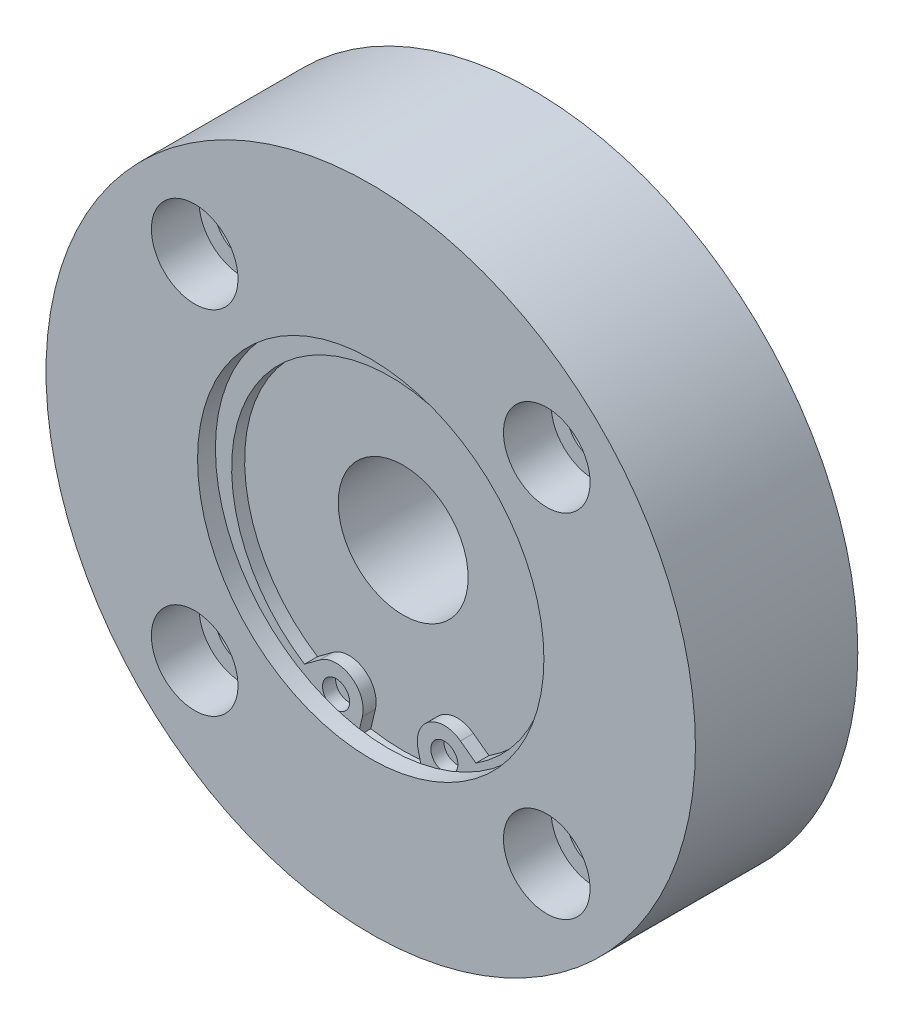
ISO-10303-21;
HEADER;
FILE_DESCRIPTION(('STEP AP214'),'2;1');
FILE_NAME('part.step','',(''),(''),'','','');
FILE_SCHEMA(('AUTOMOTIVE_DESIGN { 1 0 10303 214 1 1 1 1 }'));
ENDSEC;
DATA;
#1=APPLICATION_CONTEXT('core data for automotive mechanical design processes');
#2=APPLICATION_PROTOCOL_DEFINITION('international standard','automotive_design',2000,#1);
#3=PRODUCT_CONTEXT('',#1,'mechanical');
#4=PRODUCT('Part','Part','',(#3));
#5=PRODUCT_RELATED_PRODUCT_CATEGORY('part','',(#4));
#6=PRODUCT_DEFINITION_FORMATION('','',#4);
#7=PRODUCT_DEFINITION_CONTEXT('part definition',#1,'design');
#8=PRODUCT_DEFINITION('design','',#6,#7);
#9=PRODUCT_DEFINITION_SHAPE('','',#8);
#10=(LENGTH_UNIT() NAMED_UNIT(*) SI_UNIT(.MILLI.,.METRE.));
#11=(NAMED_UNIT(*) PLANE_ANGLE_UNIT() SI_UNIT($,.RADIAN.));
#12=(NAMED_UNIT(*) SI_UNIT($,.STERADIAN.) SOLID_ANGLE_UNIT());
#13=UNCERTAINTY_MEASURE_WITH_UNIT(LENGTH_MEASURE(1.E-05),#10,'distance_accuracy_value','');
#14=(GEOMETRIC_REPRESENTATION_CONTEXT(3) GLOBAL_UNCERTAINTY_ASSIGNED_CONTEXT((#13)) GLOBAL_UNIT_ASSIGNED_CONTEXT((#10,
#11,#12)) REPRESENTATION_CONTEXT('',''));
#15=CARTESIAN_POINT('',(0.,0.,0.));
#16=DIRECTION('',(0.,0.,1.));
#17=DIRECTION('',(1.,0.,0.));
#18=AXIS2_PLACEMENT_3D('',#15,#16,#17);
#19=CARTESIAN_POINT('',(16.2634559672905,16.2634559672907,0.));
#20=DIRECTION('',(0.,0.,1.));
#21=DIRECTION('',(1.,0.,0.));
#22=AXIS2_PLACEMENT_3D('',#19,#20,#21);
#23=CYLINDRICAL_SURFACE('',#22,2.5);
#24=CARTESIAN_POINT('',(16.2634559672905,16.2634559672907,0.));
#25=DIRECTION('',(0.,0.,1.));
#26=DIRECTION('',(1.,0.,0.));
#27=AXIS2_PLACEMENT_3D('',#24,#25,#26);
#28=CIRCLE('',#27,2.5);
#29=CARTESIAN_POINT('',(18.7634559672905,16.2634559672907,0.));
#30=VERTEX_POINT('',#29);
#31=EDGE_CURVE('E219',#30,#30,#28,.T.);
#32=ORIENTED_EDGE('',*,*,#31,.F.);
#33=EDGE_LOOP('',(#32));
#34=FACE_BOUND('',#33,.T.);
#35=CARTESIAN_POINT('',(16.2634559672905,16.2634559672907,10.6));
#36=DIRECTION('',(0.,0.,1.));
#37=DIRECTION('',(1.,0.,0.));
#38=AXIS2_PLACEMENT_3D('',#35,#36,#37);
#39=CIRCLE('',#38,2.5);
#40=CARTESIAN_POINT('',(18.7634559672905,16.2634559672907,10.6));
#41=VERTEX_POINT('',#40);
#42=EDGE_CURVE('E218',#41,#41,#39,.F.);
#43=ORIENTED_EDGE('',*,*,#42,.F.);
#44=EDGE_LOOP('',(#43));
#45=FACE_BOUND('',#44,.T.);
#46=ADVANCED_FACE('F14',(#34,#45),#23,.F.);
#47=CARTESIAN_POINT('',(16.2634559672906,-16.2634559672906,0.));
#48=DIRECTION('',(0.,0.,1.));
#49=DIRECTION('',(1.,0.,0.));
#50=AXIS2_PLACEMENT_3D('',#47,#48,#49);
#51=CYLINDRICAL_SURFACE('',#50,2.5);
#52=CARTESIAN_POINT('',(16.2634559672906,-16.2634559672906,0.));
#53=DIRECTION('',(0.,0.,1.));
#54=DIRECTION('',(0.,-1.,0.));
#55=AXIS2_PLACEMENT_3D('',#52,#53,#54);
#56=CIRCLE('',#55,2.5);
#57=CARTESIAN_POINT('',(16.2634559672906,-18.7634559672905,0.));
#58=VERTEX_POINT('',#57);
#59=EDGE_CURVE('E209',#58,#58,#56,.T.);
#60=ORIENTED_EDGE('',*,*,#59,.F.);
#61=EDGE_LOOP('',(#60));
#62=FACE_BOUND('',#61,.T.);
#63=CARTESIAN_POINT('',(16.2634559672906,-16.2634559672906,10.6));
#64=DIRECTION('',(0.,0.,1.));
#65=DIRECTION('',(1.,0.,0.));
#66=AXIS2_PLACEMENT_3D('',#63,#64,#65);
#67=CIRCLE('',#66,2.5);
#68=CARTESIAN_POINT('',(18.7634559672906,-16.2634559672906,10.6));
#69=VERTEX_POINT('',#68);
#70=EDGE_CURVE('E202',#69,#69,#67,.F.);
#71=ORIENTED_EDGE('',*,*,#70,.F.);
#72=EDGE_LOOP('',(#71));
#73=FACE_BOUND('',#72,.T.);
#74=ADVANCED_FACE('F320',(#62,#73),#51,.F.);
#75=CARTESIAN_POINT('',(-16.2634559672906,-16.2634559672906,0.));
#76=DIRECTION('',(0.,0.,1.));
#77=DIRECTION('',(1.,0.,0.));
#78=AXIS2_PLACEMENT_3D('',#75,#76,#77);
#79=CYLINDRICAL_SURFACE('',#78,2.5);
#80=CARTESIAN_POINT('',(-16.2634559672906,-16.2634559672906,0.));
#81=DIRECTION('',(0.,0.,1.));
#82=DIRECTION('',(-1.,0.,0.));
#83=AXIS2_PLACEMENT_3D('',#80,#81,#82);
#84=CIRCLE('',#83,2.5);
#85=CARTESIAN_POINT('',(-18.7634559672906,-16.2634559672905,0.));
#86=VERTEX_POINT('',#85);
#87=EDGE_CURVE('E206',#86,#86,#84,.T.);
#88=ORIENTED_EDGE('',*,*,#87,.F.);
#89=EDGE_LOOP('',(#88));
#90=FACE_BOUND('',#89,.T.);
#91=CARTESIAN_POINT('',(-16.2634559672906,-16.2634559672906,10.6));
#92=DIRECTION('',(0.,0.,1.));
#93=DIRECTION('',(1.,0.,0.));
#94=AXIS2_PLACEMENT_3D('',#91,#92,#93);
#95=CIRCLE('',#94,2.5);
#96=CARTESIAN_POINT('',(-13.7634559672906,-16.2634559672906,10.6));
#97=VERTEX_POINT('',#96);
#98=EDGE_CURVE('E195',#97,#97,#95,.F.);
#99=ORIENTED_EDGE('',*,*,#98,.F.);
#100=EDGE_LOOP('',(#99));
#101=FACE_BOUND('',#100,.T.);
#102=ADVANCED_FACE('F326',(#90,#101),#79,.F.);
#103=CARTESIAN_POINT('',(-16.2634559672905,16.2634559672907,0.));
#104=DIRECTION('',(0.,0.,1.));
#105=DIRECTION('',(1.,0.,0.));
#106=AXIS2_PLACEMENT_3D('',#103,#104,#105);
#107=CYLINDRICAL_SURFACE('',#106,2.5);
#108=CARTESIAN_POINT('',(-16.2634559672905,16.2634559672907,0.));
#109=DIRECTION('',(0.,0.,1.));
#110=DIRECTION('',(0.,1.,0.));
#111=AXIS2_PLACEMENT_3D('',#108,#109,#110);
#112=CIRCLE('',#111,2.5);
#113=CARTESIAN_POINT('',(-16.2634559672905,18.7634559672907,0.));
#114=VERTEX_POINT('',#113);
#115=EDGE_CURVE('E203',#114,#114,#112,.T.);
#116=ORIENTED_EDGE('',*,*,#115,.F.);
#117=EDGE_LOOP('',(#116));
#118=FACE_BOUND('',#117,.T.);
#119=CARTESIAN_POINT('',(-16.2634559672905,16.2634559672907,10.6));
#120=DIRECTION('',(0.,0.,1.));
#121=DIRECTION('',(1.,0.,0.));
#122=AXIS2_PLACEMENT_3D('',#119,#120,#121);
#123=CIRCLE('',#122,2.5);
#124=CARTESIAN_POINT('',(-13.7634559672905,16.2634559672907,10.6));
#125=VERTEX_POINT('',#124);
#126=EDGE_CURVE('E188',#125,#125,#123,.F.);
#127=ORIENTED_EDGE('',*,*,#126,.F.);
#128=EDGE_LOOP('',(#127));
#129=FACE_BOUND('',#128,.T.);
#130=ADVANCED_FACE('F519',(#118,#129),#107,.F.);
#131=CARTESIAN_POINT('',(16.2634559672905,16.2634559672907,10.6));
#132=DIRECTION('',(0.,0.,1.));
#133=DIRECTION('',(1.,0.,0.));
#134=AXIS2_PLACEMENT_3D('',#131,#132,#133);
#135=PLANE('',#134);
#136=CARTESIAN_POINT('',(16.2634559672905,16.2634559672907,10.6));
#137=DIRECTION('',(0.,0.,1.));
#138=DIRECTION('',(1.,0.,0.));
#139=AXIS2_PLACEMENT_3D('',#136,#137,#138);
#140=CIRCLE('',#139,4.);
#141=CARTESIAN_POINT('',(20.2634559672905,16.2634559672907,10.6));
#142=VERTEX_POINT('',#141);
#143=EDGE_CURVE('E215',#142,#142,#140,.T.);
#144=ORIENTED_EDGE('',*,*,#143,.T.);
#145=EDGE_LOOP('',(#144));
#146=FACE_BOUND('',#145,.T.);
#147=ORIENTED_EDGE('',*,*,#42,.T.);
#148=EDGE_LOOP('',(#147));
#149=FACE_BOUND('',#148,.T.);
#150=ADVANCED_FACE('F531',(#146,#149),#135,.T.);
#151=CARTESIAN_POINT('',(16.2634559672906,-16.2634559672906,10.6));
#152=DIRECTION('',(0.,0.,1.));
#153=DIRECTION('',(0.,-1.,0.));
#154=AXIS2_PLACEMENT_3D('',#151,#152,#153);
#155=PLANE('',#154);
#156=CARTESIAN_POINT('',(16.2634559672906,-16.2634559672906,10.6));
#157=DIRECTION('',(0.,0.,1.));
#158=DIRECTION('',(0.,-1.,0.));
#159=AXIS2_PLACEMENT_3D('',#156,#157,#158);
#160=CIRCLE('',#159,4.);
#161=CARTESIAN_POINT('',(16.2634559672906,-20.2634559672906,10.6));
#162=VERTEX_POINT('',#161);
#163=EDGE_CURVE('E199',#162,#162,#160,.T.);
#164=ORIENTED_EDGE('',*,*,#163,.T.);
#165=EDGE_LOOP('',(#164));
#166=FACE_BOUND('',#165,.T.);
#167=ORIENTED_EDGE('',*,*,#70,.T.);
#168=EDGE_LOOP('',(#167));
#169=FACE_BOUND('',#168,.T.);
#170=ADVANCED_FACE('F526',(#166,#169),#155,.T.);
#171=CARTESIAN_POINT('',(-16.2634559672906,-16.2634559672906,10.6));
#172=DIRECTION('',(0.,0.,1.));
#173=DIRECTION('',(-1.,0.,0.));
#174=AXIS2_PLACEMENT_3D('',#171,#172,#173);
#175=PLANE('',#174);
#176=CARTESIAN_POINT('',(-16.2634559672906,-16.2634559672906,10.6));
#177=DIRECTION('',(0.,0.,1.));
#178=DIRECTION('',(-1.,0.,0.));
#179=AXIS2_PLACEMENT_3D('',#176,#177,#178);
#180=CIRCLE('',#179,4.);
#181=CARTESIAN_POINT('',(-20.2634559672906,-16.2634559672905,10.6));
#182=VERTEX_POINT('',#181);
#183=EDGE_CURVE('E192',#182,#182,#180,.T.);
#184=ORIENTED_EDGE('',*,*,#183,.T.);
#185=EDGE_LOOP('',(#184));
#186=FACE_BOUND('',#185,.T.);
#187=ORIENTED_EDGE('',*,*,#98,.T.);
#188=EDGE_LOOP('',(#187));
#189=FACE_BOUND('',#188,.T.);
#190=ADVANCED_FACE('F499',(#186,#189),#175,.T.);
#191=CARTESIAN_POINT('',(-16.2634559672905,16.2634559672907,10.6));
#192=DIRECTION('',(0.,0.,1.));
#193=DIRECTION('',(0.,1.,0.));
#194=AXIS2_PLACEMENT_3D('',#191,#192,#193);
#195=PLANE('',#194);
#196=CARTESIAN_POINT('',(-16.2634559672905,16.2634559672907,10.6));
#197=DIRECTION('',(0.,0.,1.));
#198=DIRECTION('',(0.,1.,0.));
#199=AXIS2_PLACEMENT_3D('',#196,#197,#198);
#200=CIRCLE('',#199,4.);
#201=CARTESIAN_POINT('',(-16.2634559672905,20.2634559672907,10.6));
#202=VERTEX_POINT('',#201);
#203=EDGE_CURVE('E185',#202,#202,#200,.T.);
#204=ORIENTED_EDGE('',*,*,#203,.T.);
#205=EDGE_LOOP('',(#204));
#206=FACE_BOUND('',#205,.T.);
#207=ORIENTED_EDGE('',*,*,#126,.T.);
#208=EDGE_LOOP('',(#207));
#209=FACE_BOUND('',#208,.T.);
#210=ADVANCED_FACE('F344',(#206,#209),#195,.T.);
#211=CARTESIAN_POINT('',(0.,0.,0.));
#212=DIRECTION('',(0.,0.,1.));
#213=DIRECTION('',(1.,0.,0.));
#214=AXIS2_PLACEMENT_3D('',#211,#212,#213);
#215=PLANE('',#214);
#216=CARTESIAN_POINT('',(0.,0.,0.));
#217=DIRECTION('',(0.,0.,-1.));
#218=DIRECTION('',(-1.,0.,0.));
#219=AXIS2_PLACEMENT_3D('',#216,#217,#218);
#220=CIRCLE('',#219,13.);
#221=CARTESIAN_POINT('',(-13.,0.,0.));
#222=VERTEX_POINT('',#221);
#223=EDGE_CURVE('E171',#222,#222,#220,.T.);
#224=ORIENTED_EDGE('',*,*,#223,.F.);
#225=EDGE_LOOP('',(#224));
#226=FACE_BOUND('',#225,.T.);
#227=ORIENTED_EDGE('',*,*,#115,.T.);
#228=EDGE_LOOP('',(#227));
#229=FACE_BOUND('',#228,.T.);
#230=ORIENTED_EDGE('',*,*,#87,.T.);
#231=EDGE_LOOP('',(#230));
#232=FACE_BOUND('',#231,.T.);
#233=ORIENTED_EDGE('',*,*,#59,.T.);
#234=EDGE_LOOP('',(#233));
#235=FACE_BOUND('',#234,.T.);
#236=ORIENTED_EDGE('',*,*,#31,.T.);
#237=EDGE_LOOP('',(#236));
#238=FACE_BOUND('',#237,.T.);
#239=CARTESIAN_POINT('',(0.,0.,0.));
#240=DIRECTION('',(0.,0.,1.));
#241=DIRECTION('',(1.,0.,0.));
#242=AXIS2_PLACEMENT_3D('',#239,#240,#241);
#243=CIRCLE('',#242,30.);
#244=CARTESIAN_POINT('',(30.,0.,0.));
#245=VERTEX_POINT('',#244);
#246=EDGE_CURVE('E222',#245,#245,#243,.T.);
#247=ORIENTED_EDGE('',*,*,#246,.F.);
#248=EDGE_LOOP('',(#247));
#249=FACE_BOUND('',#248,.T.);
#250=ADVANCED_FACE('F340',(#226,#229,#232,#235,#238,#249),#215,.F.);
#251=CARTESIAN_POINT('',(0.,0.,15.));
#252=DIRECTION('',(0.,0.,-1.));
#253=DIRECTION('',(-1.,0.,0.));
#254=AXIS2_PLACEMENT_3D('',#251,#252,#253);
#255=CYLINDRICAL_SURFACE('',#254,30.);
#256=CARTESIAN_POINT('',(0.,0.,15.));
#257=DIRECTION('',(0.,0.,1.));
#258=DIRECTION('',(1.,0.,0.));
#259=AXIS2_PLACEMENT_3D('',#256,#257,#258);
#260=CIRCLE('',#259,30.);
#261=CARTESIAN_POINT('',(30.,0.,15.));
#262=VERTEX_POINT('',#261);
#263=EDGE_CURVE('E225',#262,#262,#260,.T.);
#264=ORIENTED_EDGE('',*,*,#263,.F.);
#265=EDGE_LOOP('',(#264));
#266=FACE_BOUND('',#265,.T.);
#267=ORIENTED_EDGE('',*,*,#246,.T.);
#268=EDGE_LOOP('',(#267));
#269=FACE_BOUND('',#268,.T.);
#270=ADVANCED_FACE('F343',(#266,#269),#255,.T.);
#271=CARTESIAN_POINT('',(16.2634559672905,16.2634559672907,10.6));
#272=DIRECTION('',(0.,0.,1.));
#273=DIRECTION('',(1.,0.,0.));
#274=AXIS2_PLACEMENT_3D('',#271,#272,#273);
#275=CYLINDRICAL_SURFACE('',#274,4.);
#276=ORIENTED_EDGE('',*,*,#143,.F.);
#277=EDGE_LOOP('',(#276));
#278=FACE_BOUND('',#277,.T.);
#279=CARTESIAN_POINT('',(16.2634559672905,16.2634559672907,15.));
#280=DIRECTION('',(0.,0.,1.));
#281=DIRECTION('',(1.,0.,0.));
#282=AXIS2_PLACEMENT_3D('',#279,#280,#281);
#283=CIRCLE('',#282,4.);
#284=CARTESIAN_POINT('',(20.2634559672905,16.2634559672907,15.));
#285=VERTEX_POINT('',#284);
#286=EDGE_CURVE('E212',#285,#285,#283,.T.);
#287=ORIENTED_EDGE('',*,*,#286,.T.);
#288=EDGE_LOOP('',(#287));
#289=FACE_BOUND('',#288,.T.);
#290=ADVANCED_FACE('F333',(#278,#289),#275,.F.);
#291=CARTESIAN_POINT('',(16.2634559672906,-16.2634559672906,10.6));
#292=DIRECTION('',(0.,0.,1.));
#293=DIRECTION('',(1.,0.,0.));
#294=AXIS2_PLACEMENT_3D('',#291,#292,#293);
#295=CYLINDRICAL_SURFACE('',#294,4.);
#296=ORIENTED_EDGE('',*,*,#163,.F.);
#297=EDGE_LOOP('',(#296));
#298=FACE_BOUND('',#297,.T.);
#299=CARTESIAN_POINT('',(16.2634559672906,-16.2634559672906,15.));
#300=DIRECTION('',(0.,0.,1.));
#301=DIRECTION('',(0.,-1.,0.));
#302=AXIS2_PLACEMENT_3D('',#299,#300,#301);
#303=CIRCLE('',#302,4.);
#304=CARTESIAN_POINT('',(16.2634559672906,-20.2634559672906,15.));
#305=VERTEX_POINT('',#304);
#306=EDGE_CURVE('E196',#305,#305,#303,.T.);
#307=ORIENTED_EDGE('',*,*,#306,.T.);
#308=EDGE_LOOP('',(#307));
#309=FACE_BOUND('',#308,.T.);
#310=ADVANCED_FACE('F509',(#298,#309),#295,.F.);
#311=CARTESIAN_POINT('',(-16.2634559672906,-16.2634559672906,10.6));
#312=DIRECTION('',(0.,0.,1.));
#313=DIRECTION('',(1.,0.,0.));
#314=AXIS2_PLACEMENT_3D('',#311,#312,#313);
#315=CYLINDRICAL_SURFACE('',#314,4.);
#316=ORIENTED_EDGE('',*,*,#183,.F.);
#317=EDGE_LOOP('',(#316));
#318=FACE_BOUND('',#317,.T.);
#319=CARTESIAN_POINT('',(-16.2634559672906,-16.2634559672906,15.));
#320=DIRECTION('',(0.,0.,1.));
#321=DIRECTION('',(-1.,0.,0.));
#322=AXIS2_PLACEMENT_3D('',#319,#320,#321);
#323=CIRCLE('',#322,4.);
#324=CARTESIAN_POINT('',(-20.2634559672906,-16.2634559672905,15.));
#325=VERTEX_POINT('',#324);
#326=EDGE_CURVE('E189',#325,#325,#323,.T.);
#327=ORIENTED_EDGE('',*,*,#326,.T.);
#328=EDGE_LOOP('',(#327));
#329=FACE_BOUND('',#328,.T.);
#330=ADVANCED_FACE('F489',(#318,#329),#315,.F.);
#331=CARTESIAN_POINT('',(-16.2634559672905,16.2634559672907,10.6));
#332=DIRECTION('',(0.,0.,1.));
#333=DIRECTION('',(1.,0.,0.));
#334=AXIS2_PLACEMENT_3D('',#331,#332,#333);
#335=CYLINDRICAL_SURFACE('',#334,4.);
#336=ORIENTED_EDGE('',*,*,#203,.F.);
#337=EDGE_LOOP('',(#336));
#338=FACE_BOUND('',#337,.T.);
#339=CARTESIAN_POINT('',(-16.2634559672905,16.2634559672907,15.));
#340=DIRECTION('',(0.,0.,1.));
#341=DIRECTION('',(0.,1.,0.));
#342=AXIS2_PLACEMENT_3D('',#339,#340,#341);
#343=CIRCLE('',#342,4.);
#344=CARTESIAN_POINT('',(-16.2634559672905,20.2634559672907,15.));
#345=VERTEX_POINT('',#344);
#346=EDGE_CURVE('E182',#345,#345,#343,.T.);
#347=ORIENTED_EDGE('',*,*,#346,.T.);
#348=EDGE_LOOP('',(#347));
#349=FACE_BOUND('',#348,.T.);
#350=ADVANCED_FACE('F480',(#338,#349),#335,.F.);
#351=CARTESIAN_POINT('',(0.,0.,2.));
#352=DIRECTION('',(0.,0.,-1.));
#353=DIRECTION('',(-1.,0.,0.));
#354=AXIS2_PLACEMENT_3D('',#351,#352,#353);
#355=CYLINDRICAL_SURFACE('',#354,13.);
#356=CARTESIAN_POINT('',(0.,0.,2.));
#357=DIRECTION('',(0.,0.,-1.));
#358=DIRECTION('',(-1.,0.,0.));
#359=AXIS2_PLACEMENT_3D('',#356,#357,#358);
#360=CIRCLE('',#359,13.);
#361=CARTESIAN_POINT('',(-13.,0.,2.));
#362=VERTEX_POINT('',#361);
#363=EDGE_CURVE('E174',#362,#362,#360,.T.);
#364=ORIENTED_EDGE('',*,*,#363,.F.);
#365=EDGE_LOOP('',(#364));
#366=FACE_BOUND('',#365,.T.);
#367=ORIENTED_EDGE('',*,*,#223,.T.);
#368=EDGE_LOOP('',(#367));
#369=FACE_BOUND('',#368,.T.);
#370=ADVANCED_FACE('F350',(#366,#369),#355,.F.);
#371=CARTESIAN_POINT('',(0.,0.,15.));
#372=DIRECTION('',(0.,0.,1.));
#373=DIRECTION('',(1.,0.,0.));
#374=AXIS2_PLACEMENT_3D('',#371,#372,#373);
#375=PLANE('',#374);
#376=CARTESIAN_POINT('',(0.,0.,15.));
#377=DIRECTION('',(0.,0.,1.));
#378=DIRECTION('',(1.,0.,0.));
#379=AXIS2_PLACEMENT_3D('',#376,#377,#378);
#380=CIRCLE('',#379,16.);
#381=CARTESIAN_POINT('',(16.,0.,15.));
#382=VERTEX_POINT('',#381);
#383=EDGE_CURVE('E178',#382,#382,#380,.T.);
#384=ORIENTED_EDGE('',*,*,#383,.F.);
#385=EDGE_LOOP('',(#384));
#386=FACE_BOUND('',#385,.T.);
#387=ORIENTED_EDGE('',*,*,#346,.F.);
#388=EDGE_LOOP('',(#387));
#389=FACE_BOUND('',#388,.T.);
#390=ORIENTED_EDGE('',*,*,#326,.F.);
#391=EDGE_LOOP('',(#390));
#392=FACE_BOUND('',#391,.T.);
#393=ORIENTED_EDGE('',*,*,#306,.F.);
#394=EDGE_LOOP('',(#393));
#395=FACE_BOUND('',#394,.T.);
#396=ORIENTED_EDGE('',*,*,#286,.F.);
#397=EDGE_LOOP('',(#396));
#398=FACE_BOUND('',#397,.T.);
#399=ORIENTED_EDGE('',*,*,#263,.T.);
#400=EDGE_LOOP('',(#399));
#401=FACE_BOUND('',#400,.T.);
#402=ADVANCED_FACE('F346',(#386,#389,#392,#395,#398,#401),#375,.T.);
#403=CARTESIAN_POINT('',(0.,0.,2.));
#404=DIRECTION('',(0.,0.,-1.));
#405=DIRECTION('',(-1.,0.,0.));
#406=AXIS2_PLACEMENT_3D('',#403,#404,#405);
#407=PLANE('',#406);
#408=CARTESIAN_POINT('',(0.,0.,2.));
#409=DIRECTION('',(0.,0.,-1.));
#410=DIRECTION('',(-1.,0.,0.));
#411=AXIS2_PLACEMENT_3D('',#408,#409,#410);
#412=CIRCLE('',#411,6.);
#413=CARTESIAN_POINT('',(-6.,0.,2.));
#414=VERTEX_POINT('',#413);
#415=EDGE_CURVE('E177',#414,#414,#412,.T.);
#416=ORIENTED_EDGE('',*,*,#415,.F.);
#417=EDGE_LOOP('',(#416));
#418=FACE_BOUND('',#417,.T.);
#419=ORIENTED_EDGE('',*,*,#363,.T.);
#420=EDGE_LOOP('',(#419));
#421=FACE_BOUND('',#420,.T.);
#422=ADVANCED_FACE('F349',(#418,#421),#407,.T.);
#423=CARTESIAN_POINT('',(0.,0.,12.));
#424=DIRECTION('',(0.,0.,1.));
#425=DIRECTION('',(1.,0.,0.));
#426=AXIS2_PLACEMENT_3D('',#423,#424,#425);
#427=CYLINDRICAL_SURFACE('',#426,16.);
#428=CARTESIAN_POINT('',(0.,0.,13.35));
#429=DIRECTION('',(0.,0.,1.));
#430=DIRECTION('',(1.,0.,0.));
#431=AXIS2_PLACEMENT_3D('',#428,#429,#430);
#432=CIRCLE('',#431,16.);
#433=CARTESIAN_POINT('',(16.,0.,13.35));
#434=VERTEX_POINT('',#433);
#435=EDGE_CURVE('E168',#434,#434,#432,.F.);
#436=ORIENTED_EDGE('',*,*,#435,.T.);
#437=EDGE_LOOP('',(#436));
#438=FACE_BOUND('',#437,.T.);
#439=ORIENTED_EDGE('',*,*,#383,.T.);
#440=EDGE_LOOP('',(#439));
#441=FACE_BOUND('',#440,.T.);
#442=ADVANCED_FACE('F338',(#438,#441),#427,.F.);
#443=CARTESIAN_POINT('',(0.,0.,15.));
#444=DIRECTION('',(0.,0.,-1.));
#445=DIRECTION('',(-1.,0.,0.));
#446=AXIS2_PLACEMENT_3D('',#443,#444,#445);
#447=CYLINDRICAL_SURFACE('',#446,6.);
#448=CARTESIAN_POINT('',(0.,0.,12.));
#449=DIRECTION('',(0.,0.,1.));
#450=DIRECTION('',(1.,0.,0.));
#451=AXIS2_PLACEMENT_3D('',#448,#449,#450);
#452=CIRCLE('',#451,6.);
#453=CARTESIAN_POINT('',(6.,0.,12.));
#454=VERTEX_POINT('',#453);
#455=EDGE_CURVE('E181',#454,#454,#452,.T.);
#456=ORIENTED_EDGE('',*,*,#455,.T.);
#457=EDGE_LOOP('',(#456));
#458=FACE_BOUND('',#457,.T.);
#459=ORIENTED_EDGE('',*,*,#415,.T.);
#460=EDGE_LOOP('',(#459));
#461=FACE_BOUND('',#460,.T.);
#462=ADVANCED_FACE('F335',(#458,#461),#447,.F.);
#463=CARTESIAN_POINT('',(0.,0.,12.));
#464=DIRECTION('',(0.,0.,1.));
#465=DIRECTION('',(1.,0.,0.));
#466=AXIS2_PLACEMENT_3D('',#463,#464,#465);
#467=PLANE('',#466);
#468=ORIENTED_EDGE('',*,*,#455,.F.);
#469=EDGE_LOOP('',(#468));
#470=FACE_BOUND('',#469,.T.);
#471=CARTESIAN_POINT('',(0.,0.,12.));
#472=DIRECTION('',(0.,0.,1.));
#473=DIRECTION('',(1.,0.,0.));
#474=AXIS2_PLACEMENT_3D('',#471,#472,#473);
#475=CIRCLE('',#474,16.85);
#476=CARTESIAN_POINT('',(-2.99125499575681,-16.5823669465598,12.));
#477=VERTEX_POINT('',#476);
#478=CARTESIAN_POINT('',(2.99125499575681,-16.5823669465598,12.));
#479=VERTEX_POINT('',#478);
#480=EDGE_CURVE('E153',#477,#479,#475,.T.);
#481=ORIENTED_EDGE('',*,*,#480,.T.);
#482=DIRECTION('',(-0.231349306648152,0.972870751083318,0.));
#483=VECTOR('',#482,1.);
#484=CARTESIAN_POINT('',(-0.901087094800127,-0.214279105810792,12.));
#485=LINE('',#484,#483);
#486=CARTESIAN_POINT('',(2.56782312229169,-14.8017500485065,12.));
#487=VERTEX_POINT('',#486);
#488=EDGE_CURVE('E9',#479,#487,#485,.T.);
#489=ORIENTED_EDGE('',*,*,#488,.T.);
#490=CARTESIAN_POINT('',(5.,-14.2233767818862,12.));
#491=DIRECTION('',(0.,0.,1.));
#492=DIRECTION('',(1.,0.,0.));
#493=AXIS2_PLACEMENT_3D('',#490,#491,#492);
#494=CIRCLE('',#493,2.5);
#495=CARTESIAN_POINT('',(6.49138441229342,-12.2169439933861,12.));
#496=VERTEX_POINT('',#495);
#497=EDGE_CURVE('E25',#496,#487,#494,.T.);
#498=ORIENTED_EDGE('',*,*,#497,.F.);
#499=DIRECTION('',(0.802573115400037,-0.596553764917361,0.));
#500=VECTOR('',#499,1.);
#501=CARTESIAN_POINT('',(-3.53907369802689,-4.76128987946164,12.));
#502=LINE('',#501,#500);
#503=CARTESIAN_POINT('',(7.91695293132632,-13.2765711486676,12.));
#504=VERTEX_POINT('',#503);
#505=EDGE_CURVE('E72',#496,#504,#502,.T.);
#506=ORIENTED_EDGE('',*,*,#505,.T.);
#507=CARTESIAN_POINT('',(0.,-0.95,12.));
#508=DIRECTION('',(0.,0.,1.));
#509=DIRECTION('',(1.,0.,0.));
#510=AXIS2_PLACEMENT_3D('',#507,#508,#509);
#511=CIRCLE('',#510,14.65);
#512=CARTESIAN_POINT('',(-7.91695293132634,-13.2765711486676,12.));
#513=VERTEX_POINT('',#512);
#514=EDGE_CURVE('E268',#504,#513,#511,.T.);
#515=ORIENTED_EDGE('',*,*,#514,.T.);
#516=DIRECTION('',(0.802573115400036,0.596553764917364,0.));
#517=VECTOR('',#516,1.);
#518=CARTESIAN_POINT('',(3.53907369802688,-4.7612898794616,12.));
#519=LINE('',#518,#517);
#520=CARTESIAN_POINT('',(-6.49138441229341,-12.2169439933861,12.));
#521=VERTEX_POINT('',#520);
#522=EDGE_CURVE('E264',#513,#521,#519,.T.);
#523=ORIENTED_EDGE('',*,*,#522,.T.);
#524=CARTESIAN_POINT('',(-5.,-14.2233767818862,12.));
#525=DIRECTION('',(0.,0.,1.));
#526=DIRECTION('',(1.,0.,0.));
#527=AXIS2_PLACEMENT_3D('',#524,#525,#526);
#528=CIRCLE('',#527,2.5);
#529=CARTESIAN_POINT('',(-2.56782312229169,-14.8017500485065,12.));
#530=VERTEX_POINT('',#529);
#531=EDGE_CURVE('E259',#530,#521,#528,.T.);
#532=ORIENTED_EDGE('',*,*,#531,.F.);
#533=DIRECTION('',(-0.231349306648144,-0.97287075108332,0.));
#534=VECTOR('',#533,1.);
#535=CARTESIAN_POINT('',(0.901087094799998,-0.214279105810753,12.));
#536=LINE('',#535,#534);
#537=EDGE_CURVE('E262',#530,#477,#536,.T.);
#538=ORIENTED_EDGE('',*,*,#537,.T.);
#539=EDGE_LOOP('',(#481,#489,#498,#506,#515,#523,#532,#538));
#540=FACE_BOUND('',#539,.T.);
#541=ADVANCED_FACE('F303',(#470,#540),#467,.T.);
#542=CARTESIAN_POINT('',(0.,0.,13.35));
#543=DIRECTION('',(0.,0.,1.));
#544=DIRECTION('',(1.,0.,0.));
#545=AXIS2_PLACEMENT_3D('',#542,#543,#544);
#546=PLANE('',#545);
#547=CARTESIAN_POINT('',(0.,0.,13.35));
#548=DIRECTION('',(0.,0.,1.));
#549=DIRECTION('',(1.,0.,0.));
#550=AXIS2_PLACEMENT_3D('',#547,#548,#549);
#551=CIRCLE('',#550,16.85);
#552=CARTESIAN_POINT('',(16.85,0.,13.35));
#553=VERTEX_POINT('',#552);
#554=EDGE_CURVE('E161',#553,#553,#551,.T.);
#555=ORIENTED_EDGE('',*,*,#554,.F.);
#556=EDGE_LOOP('',(#555));
#557=FACE_BOUND('',#556,.T.);
#558=ORIENTED_EDGE('',*,*,#435,.F.);
#559=EDGE_LOOP('',(#558));
#560=FACE_BOUND('',#559,.T.);
#561=ADVANCED_FACE('F438',(#557,#560),#546,.F.);
#562=CARTESIAN_POINT('',(0.,0.,13.35));
#563=DIRECTION('',(0.,0.,-1.));
#564=DIRECTION('',(-1.,0.,0.));
#565=AXIS2_PLACEMENT_3D('',#562,#563,#564);
#566=CYLINDRICAL_SURFACE('',#565,16.85);
#567=ORIENTED_EDGE('',*,*,#554,.T.);
#568=EDGE_LOOP('',(#567));
#569=FACE_BOUND('',#568,.T.);
#570=CARTESIAN_POINT('',(0.,0.,13.2));
#571=DIRECTION('',(0.,0.,-1.));
#572=DIRECTION('',(-1.,0.,0.));
#573=AXIS2_PLACEMENT_3D('',#570,#571,#572);
#574=CIRCLE('',#573,16.85);
#575=CARTESIAN_POINT('',(-2.99125499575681,-16.5823669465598,13.2));
#576=VERTEX_POINT('',#575);
#577=CARTESIAN_POINT('',(2.99125499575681,-16.5823669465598,13.2));
#578=VERTEX_POINT('',#577);
#579=EDGE_CURVE('E245',#576,#578,#574,.T.);
#580=ORIENTED_EDGE('',*,*,#579,.T.);
#581=DIRECTION('',(0.,0.,-1.));
#582=VECTOR('',#581,1.);
#583=CARTESIAN_POINT('',(2.99125499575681,-16.5823669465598,13.35));
#584=LINE('',#583,#582);
#585=EDGE_CURVE('E248',#578,#479,#584,.T.);
#586=ORIENTED_EDGE('',*,*,#585,.T.);
#587=ORIENTED_EDGE('',*,*,#480,.F.);
#588=DIRECTION('',(0.,0.,-1.));
#589=VECTOR('',#588,1.);
#590=CARTESIAN_POINT('',(-2.99125499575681,-16.5823669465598,13.35));
#591=LINE('',#590,#589);
#592=EDGE_CURVE('E228',#477,#576,#591,.F.);
#593=ORIENTED_EDGE('',*,*,#592,.T.);
#594=EDGE_LOOP('',(#580,#586,#587,#593));
#595=FACE_BOUND('',#594,.T.);
#596=ADVANCED_FACE('F304',(#569,#595),#566,.F.);
#597=CARTESIAN_POINT('',(5.,-14.2233767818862,12.));
#598=DIRECTION('',(0.,0.,1.));
#599=DIRECTION('',(1.,0.,0.));
#600=AXIS2_PLACEMENT_3D('',#597,#598,#599);
#601=CIRCLE('',#600,1.25);
#602=CARTESIAN_POINT('',(6.25,-14.2233767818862,12.));
#603=VERTEX_POINT('',#602);
#604=EDGE_CURVE('E251',#603,#603,#601,.T.);
#605=ORIENTED_EDGE('',*,*,#604,.T.);
#606=EDGE_LOOP('',(#605));
#607=FACE_BOUND('',#606,.T.);
#608=ADVANCED_FACE('F369',(#607),#467,.T.);
#609=CARTESIAN_POINT('',(-5.,-14.2233767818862,12.));
#610=DIRECTION('',(0.,0.,1.));
#611=DIRECTION('',(1.,0.,0.));
#612=AXIS2_PLACEMENT_3D('',#609,#610,#611);
#613=CIRCLE('',#612,1.25);
#614=CARTESIAN_POINT('',(-3.75,-14.2233767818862,12.));
#615=VERTEX_POINT('',#614);
#616=EDGE_CURVE('E255',#615,#615,#613,.T.);
#617=ORIENTED_EDGE('',*,*,#616,.T.);
#618=EDGE_LOOP('',(#617));
#619=FACE_BOUND('',#618,.T.);
#620=ADVANCED_FACE('F316',(#619),#467,.T.);
#621=CARTESIAN_POINT('',(6.49138441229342,-12.2169439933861,13.2));
#622=DIRECTION('',(-0.596553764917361,-0.802573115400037,0.));
#623=DIRECTION('',(-0.802573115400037,0.596553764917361,0.));
#624=AXIS2_PLACEMENT_3D('',#621,#622,#623);
#625=PLANE('',#624);
#626=ORIENTED_EDGE('',*,*,#505,.F.);
#627=DIRECTION('',(0.,0.,-1.));
#628=VECTOR('',#627,1.);
#629=CARTESIAN_POINT('',(6.49138441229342,-12.2169439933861,13.2));
#630=LINE('',#629,#628);
#631=CARTESIAN_POINT('',(6.49138441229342,-12.2169439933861,13.2));
#632=VERTEX_POINT('',#631);
#633=EDGE_CURVE('E66',#632,#496,#630,.T.);
#634=ORIENTED_EDGE('',*,*,#633,.F.);
#635=DIRECTION('',(-0.802573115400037,0.596553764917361,0.));
#636=VECTOR('',#635,1.);
#637=CARTESIAN_POINT('',(6.49138441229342,-12.2169439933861,13.2));
#638=LINE('',#637,#636);
#639=CARTESIAN_POINT('',(7.91695293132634,-13.2765711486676,13.2));
#640=VERTEX_POINT('',#639);
#641=EDGE_CURVE('E70',#640,#632,#638,.T.);
#642=ORIENTED_EDGE('',*,*,#641,.F.);
#643=DIRECTION('',(0.,0.,-1.));
#644=VECTOR('',#643,1.);
#645=CARTESIAN_POINT('',(7.91695293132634,-13.2765711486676,13.2));
#646=LINE('',#645,#644);
#647=EDGE_CURVE('E120',#640,#504,#646,.T.);
#648=ORIENTED_EDGE('',*,*,#647,.T.);
#649=EDGE_LOOP('',(#626,#634,#642,#648));
#650=FACE_BOUND('',#649,.T.);
#651=ADVANCED_FACE('F68',(#650),#625,.F.);
#652=CARTESIAN_POINT('',(0.,-0.95,13.2));
#653=DIRECTION('',(0.,0.,1.));
#654=DIRECTION('',(-1.,0.,0.));
#655=AXIS2_PLACEMENT_3D('',#652,#653,#654);
#656=CYLINDRICAL_SURFACE('',#655,14.65);
#657=ORIENTED_EDGE('',*,*,#514,.F.);
#658=ORIENTED_EDGE('',*,*,#647,.F.);
#659=CARTESIAN_POINT('',(0.,-0.95,13.2));
#660=DIRECTION('',(0.,0.,-1.));
#661=DIRECTION('',(0.,-1.,0.));
#662=AXIS2_PLACEMENT_3D('',#659,#660,#661);
#663=CIRCLE('',#662,14.65);
#664=CARTESIAN_POINT('',(-7.91695293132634,-13.2765711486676,13.2));
#665=VERTEX_POINT('',#664);
#666=EDGE_CURVE('E84',#665,#640,#663,.T.);
#667=ORIENTED_EDGE('',*,*,#666,.F.);
#668=DIRECTION('',(0.,0.,-1.));
#669=VECTOR('',#668,1.);
#670=CARTESIAN_POINT('',(-7.91695293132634,-13.2765711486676,13.2));
#671=LINE('',#670,#669);
#672=EDGE_CURVE('E122',#665,#513,#671,.T.);
#673=ORIENTED_EDGE('',*,*,#672,.T.);
#674=EDGE_LOOP('',(#657,#658,#667,#673));
#675=FACE_BOUND('',#674,.T.);
#676=ADVANCED_FACE('F306',(#675),#656,.F.);
#677=CARTESIAN_POINT('',(-6.49138441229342,-12.2169439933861,13.2));
#678=DIRECTION('',(0.596553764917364,-0.802573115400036,0.));
#679=DIRECTION('',(0.,0.,-1.));
#680=AXIS2_PLACEMENT_3D('',#677,#678,#679);
#681=PLANE('',#680);
#682=ORIENTED_EDGE('',*,*,#522,.F.);
#683=ORIENTED_EDGE('',*,*,#672,.F.);
#684=DIRECTION('',(-0.802573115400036,-0.596553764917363,0.));
#685=VECTOR('',#684,1.);
#686=CARTESIAN_POINT('',(-6.49138441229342,-12.2169439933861,13.2));
#687=LINE('',#686,#685);
#688=CARTESIAN_POINT('',(-6.49138441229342,-12.2169439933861,13.2));
#689=VERTEX_POINT('',#688);
#690=EDGE_CURVE('E123',#689,#665,#687,.T.);
#691=ORIENTED_EDGE('',*,*,#690,.F.);
#692=DIRECTION('',(0.,0.,-1.));
#693=VECTOR('',#692,1.);
#694=CARTESIAN_POINT('',(-6.49138441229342,-12.2169439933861,13.2));
#695=LINE('',#694,#693);
#696=EDGE_CURVE('E102',#689,#521,#695,.T.);
#697=ORIENTED_EDGE('',*,*,#696,.T.);
#698=EDGE_LOOP('',(#682,#683,#691,#697));
#699=FACE_BOUND('',#698,.T.);
#700=ADVANCED_FACE('F308',(#699),#681,.F.);
#701=CARTESIAN_POINT('',(-5.,-14.2233767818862,13.2));
#702=DIRECTION('',(0.,0.,1.));
#703=DIRECTION('',(-1.,0.,0.));
#704=AXIS2_PLACEMENT_3D('',#701,#702,#703);
#705=CYLINDRICAL_SURFACE('',#704,1.25);
#706=ORIENTED_EDGE('',*,*,#616,.F.);
#707=EDGE_LOOP('',(#706));
#708=FACE_BOUND('',#707,.T.);
#709=CARTESIAN_POINT('',(-5.,-14.2233767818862,13.2));
#710=DIRECTION('',(0.,0.,-1.));
#711=DIRECTION('',(1.,0.,0.));
#712=AXIS2_PLACEMENT_3D('',#709,#710,#711);
#713=CIRCLE('',#712,1.25);
#714=CARTESIAN_POINT('',(-3.75,-14.2233767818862,13.2));
#715=VERTEX_POINT('',#714);
#716=EDGE_CURVE('E75',#715,#715,#713,.T.);
#717=ORIENTED_EDGE('',*,*,#716,.F.);
#718=EDGE_LOOP('',(#717));
#719=FACE_BOUND('',#718,.T.);
#720=ADVANCED_FACE('F314',(#708,#719),#705,.F.);
#721=CARTESIAN_POINT('',(5.,-14.2233767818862,13.2));
#722=DIRECTION('',(0.,0.,1.));
#723=DIRECTION('',(-1.,0.,0.));
#724=AXIS2_PLACEMENT_3D('',#721,#722,#723);
#725=CYLINDRICAL_SURFACE('',#724,1.25);
#726=ORIENTED_EDGE('',*,*,#604,.F.);
#727=EDGE_LOOP('',(#726));
#728=FACE_BOUND('',#727,.T.);
#729=CARTESIAN_POINT('',(5.,-14.2233767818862,13.2));
#730=DIRECTION('',(0.,0.,1.));
#731=DIRECTION('',(1.,0.,0.));
#732=AXIS2_PLACEMENT_3D('',#729,#730,#731);
#733=CIRCLE('',#732,1.25);
#734=CARTESIAN_POINT('',(6.25,-14.2233767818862,13.2));
#735=VERTEX_POINT('',#734);
#736=EDGE_CURVE('E115',#735,#735,#733,.T.);
#737=ORIENTED_EDGE('',*,*,#736,.T.);
#738=EDGE_LOOP('',(#737));
#739=FACE_BOUND('',#738,.T.);
#740=ADVANCED_FACE('F356',(#728,#739),#725,.F.);
#741=CARTESIAN_POINT('',(5.,-14.2233767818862,13.2));
#742=DIRECTION('',(0.,0.,1.));
#743=DIRECTION('',(-1.,0.,0.));
#744=AXIS2_PLACEMENT_3D('',#741,#742,#743);
#745=CYLINDRICAL_SURFACE('',#744,2.5);
#746=ORIENTED_EDGE('',*,*,#497,.T.);
#747=DIRECTION('',(0.,0.,-1.));
#748=VECTOR('',#747,1.);
#749=CARTESIAN_POINT('',(2.5678231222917,-14.8017500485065,13.2));
#750=LINE('',#749,#748);
#751=CARTESIAN_POINT('',(2.5678231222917,-14.8017500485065,13.2));
#752=VERTEX_POINT('',#751);
#753=EDGE_CURVE('E76',#752,#487,#750,.T.);
#754=ORIENTED_EDGE('',*,*,#753,.F.);
#755=CARTESIAN_POINT('',(5.,-14.2233767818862,13.2));
#756=DIRECTION('',(0.,0.,1.));
#757=DIRECTION('',(1.,0.,0.));
#758=AXIS2_PLACEMENT_3D('',#755,#756,#757);
#759=CIRCLE('',#758,2.5);
#760=EDGE_CURVE('E18',#632,#752,#759,.T.);
#761=ORIENTED_EDGE('',*,*,#760,.F.);
#762=ORIENTED_EDGE('',*,*,#633,.T.);
#763=EDGE_LOOP('',(#746,#754,#761,#762));
#764=FACE_BOUND('',#763,.T.);
#765=ADVANCED_FACE('F16',(#764),#745,.T.);
#766=CARTESIAN_POINT('',(0.,-0.95,13.2));
#767=DIRECTION('',(0.,0.,-1.));
#768=DIRECTION('',(0.,-1.,0.));
#769=AXIS2_PLACEMENT_3D('',#766,#767,#768);
#770=PLANE('',#769);
#771=ORIENTED_EDGE('',*,*,#736,.F.);
#772=EDGE_LOOP('',(#771));
#773=FACE_BOUND('',#772,.T.);
#774=ORIENTED_EDGE('',*,*,#716,.T.);
#775=EDGE_LOOP('',(#774));
#776=FACE_BOUND('',#775,.T.);
#777=ORIENTED_EDGE('',*,*,#579,.F.);
#778=DIRECTION('',(0.231349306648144,0.97287075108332,0.));
#779=VECTOR('',#778,1.);
#780=CARTESIAN_POINT('',(-2.56782312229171,-14.8017500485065,13.2));
#781=LINE('',#780,#779);
#782=CARTESIAN_POINT('',(-2.56782312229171,-14.8017500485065,13.2));
#783=VERTEX_POINT('',#782);
#784=EDGE_CURVE('E93',#576,#783,#781,.T.);
#785=ORIENTED_EDGE('',*,*,#784,.T.);
#786=CARTESIAN_POINT('',(-5.,-14.2233767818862,13.2));
#787=DIRECTION('',(0.,0.,1.));
#788=DIRECTION('',(-1.,0.,0.));
#789=AXIS2_PLACEMENT_3D('',#786,#787,#788);
#790=CIRCLE('',#789,2.5);
#791=EDGE_CURVE('E99',#783,#689,#790,.T.);
#792=ORIENTED_EDGE('',*,*,#791,.T.);
#793=ORIENTED_EDGE('',*,*,#690,.T.);
#794=ORIENTED_EDGE('',*,*,#666,.T.);
#795=ORIENTED_EDGE('',*,*,#641,.T.);
#796=ORIENTED_EDGE('',*,*,#760,.T.);
#797=DIRECTION('',(0.231349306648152,-0.972870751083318,0.));
#798=VECTOR('',#797,1.);
#799=CARTESIAN_POINT('',(2.5678231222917,-14.8017500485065,13.2));
#800=LINE('',#799,#798);
#801=EDGE_CURVE('E90',#752,#578,#800,.T.);
#802=ORIENTED_EDGE('',*,*,#801,.T.);
#803=EDGE_LOOP('',(#777,#785,#792,#793,#794,#795,#796,#802));
#804=FACE_BOUND('',#803,.T.);
#805=ADVANCED_FACE('F81',(#773,#776,#804),#770,.F.);
#806=CARTESIAN_POINT('',(-5.,-14.2233767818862,13.2));
#807=DIRECTION('',(0.,0.,1.));
#808=DIRECTION('',(-1.,0.,0.));
#809=AXIS2_PLACEMENT_3D('',#806,#807,#808);
#810=CYLINDRICAL_SURFACE('',#809,2.5);
#811=ORIENTED_EDGE('',*,*,#531,.T.);
#812=ORIENTED_EDGE('',*,*,#696,.F.);
#813=ORIENTED_EDGE('',*,*,#791,.F.);
#814=DIRECTION('',(0.,0.,-1.));
#815=VECTOR('',#814,1.);
#816=CARTESIAN_POINT('',(-2.56782312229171,-14.8017500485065,13.2));
#817=LINE('',#816,#815);
#818=EDGE_CURVE('E119',#783,#530,#817,.T.);
#819=ORIENTED_EDGE('',*,*,#818,.T.);
#820=EDGE_LOOP('',(#811,#812,#813,#819));
#821=FACE_BOUND('',#820,.T.);
#822=ADVANCED_FACE('F358',(#821),#810,.T.);
#823=CARTESIAN_POINT('',(-2.56782312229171,-14.8017500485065,13.2));
#824=DIRECTION('',(-0.97287075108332,0.231349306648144,0.));
#825=DIRECTION('',(0.,0.,1.));
#826=AXIS2_PLACEMENT_3D('',#823,#824,#825);
#827=PLANE('',#826);
#828=ORIENTED_EDGE('',*,*,#592,.F.);
#829=ORIENTED_EDGE('',*,*,#537,.F.);
#830=ORIENTED_EDGE('',*,*,#818,.F.);
#831=ORIENTED_EDGE('',*,*,#784,.F.);
#832=EDGE_LOOP('',(#828,#829,#830,#831));
#833=FACE_BOUND('',#832,.T.);
#834=ADVANCED_FACE('F301',(#833),#827,.F.);
#835=CARTESIAN_POINT('',(2.5678231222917,-14.8017500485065,13.2));
#836=DIRECTION('',(0.972870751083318,0.231349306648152,0.));
#837=DIRECTION('',(0.,0.,-1.));
#838=AXIS2_PLACEMENT_3D('',#835,#836,#837);
#839=PLANE('',#838);
#840=ORIENTED_EDGE('',*,*,#585,.F.);
#841=ORIENTED_EDGE('',*,*,#801,.F.);
#842=ORIENTED_EDGE('',*,*,#753,.T.);
#843=ORIENTED_EDGE('',*,*,#488,.F.);
#844=EDGE_LOOP('',(#840,#841,#842,#843));
#845=FACE_BOUND('',#844,.T.);
#846=ADVANCED_FACE('F305',(#845),#839,.F.);
#847=CLOSED_SHELL('',(#46,#74,#102,#130,#150,#170,#190,#210,#250,#270,#290,#310,#330,#350,#370,
#402,#422,#442,#462,#541,#561,#596,#608,#620,#651,#676,#700,#720,#740,#765,#805,#822,#834,#846));
#848=MANIFOLD_SOLID_BREP('B1',#847);
#849=ADVANCED_BREP_SHAPE_REPRESENTATION('',(#18,#848),#14);
#850=SHAPE_DEFINITION_REPRESENTATION(#9,#849);
ENDSEC;
END-ISO-10303-21;
